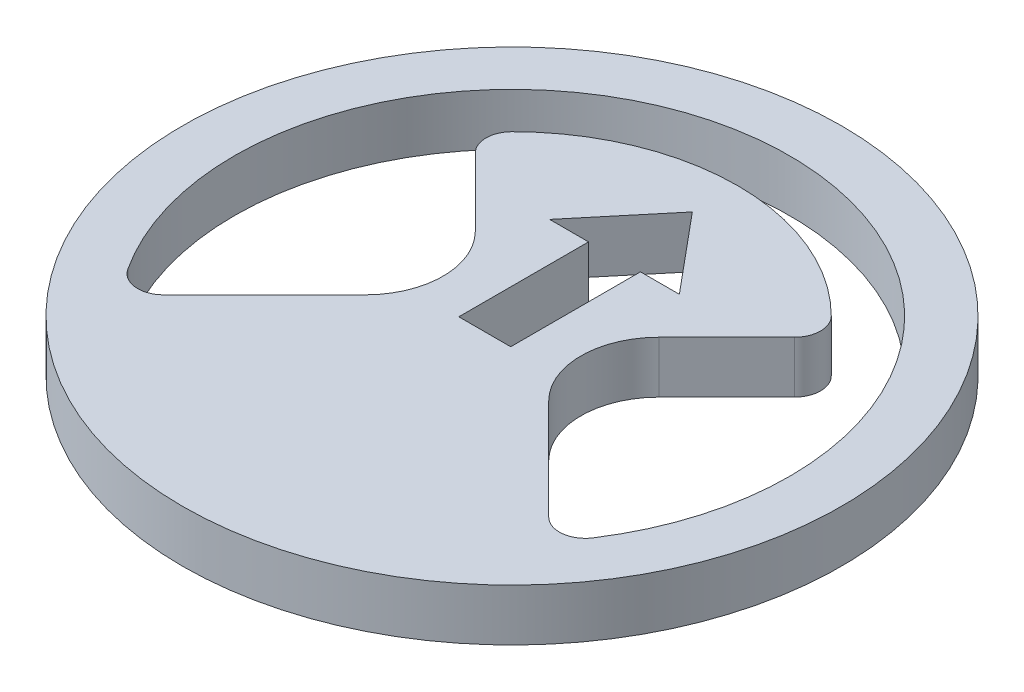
ISO-10303-21;
HEADER;
FILE_DESCRIPTION(('STEP AP214'),'2;1');
FILE_NAME('part.step','',(''),(''),'','','');
FILE_SCHEMA(('AUTOMOTIVE_DESIGN { 1 0 10303 214 1 1 1 1 }'));
ENDSEC;
DATA;
#1=APPLICATION_CONTEXT('core data for automotive mechanical design processes');
#2=APPLICATION_PROTOCOL_DEFINITION('international standard','automotive_design',2000,#1);
#3=PRODUCT_CONTEXT('',#1,'mechanical');
#4=PRODUCT('Part','Part','',(#3));
#5=PRODUCT_RELATED_PRODUCT_CATEGORY('part','',(#4));
#6=PRODUCT_DEFINITION_FORMATION('','',#4);
#7=PRODUCT_DEFINITION_CONTEXT('part definition',#1,'design');
#8=PRODUCT_DEFINITION('design','',#6,#7);
#9=PRODUCT_DEFINITION_SHAPE('','',#8);
#10=(LENGTH_UNIT() NAMED_UNIT(*) SI_UNIT(.MILLI.,.METRE.));
#11=(NAMED_UNIT(*) PLANE_ANGLE_UNIT() SI_UNIT($,.RADIAN.));
#12=(NAMED_UNIT(*) SI_UNIT($,.STERADIAN.) SOLID_ANGLE_UNIT());
#13=UNCERTAINTY_MEASURE_WITH_UNIT(LENGTH_MEASURE(1.E-05),#10,'distance_accuracy_value','');
#14=(GEOMETRIC_REPRESENTATION_CONTEXT(3) GLOBAL_UNCERTAINTY_ASSIGNED_CONTEXT((#13)) GLOBAL_UNIT_ASSIGNED_CONTEXT((#10,
#11,#12)) REPRESENTATION_CONTEXT('',''));
#15=CARTESIAN_POINT('',(0.,0.,0.));
#16=DIRECTION('',(0.,0.,1.));
#17=DIRECTION('',(1.,0.,0.));
#18=AXIS2_PLACEMENT_3D('',#15,#16,#17);
#19=CARTESIAN_POINT('',(0.,2.,0.));
#20=DIRECTION('',(0.,1.,0.));
#21=DIRECTION('',(0.,0.,1.));
#22=AXIS2_PLACEMENT_3D('',#19,#20,#21);
#23=PLANE('',#22);
#24=CARTESIAN_POINT('',(0.,2.,0.));
#25=DIRECTION('',(0.,1.,0.));
#26=DIRECTION('',(0.,0.,1.));
#27=AXIS2_PLACEMENT_3D('',#24,#25,#26);
#28=CIRCLE('',#27,12.7);
#29=CARTESIAN_POINT('',(0.,2.,12.7));
#30=VERTEX_POINT('',#29);
#31=EDGE_CURVE('E234',#30,#30,#28,.T.);
#32=ORIENTED_EDGE('',*,*,#31,.T.);
#33=EDGE_LOOP('',(#32));
#34=FACE_BOUND('',#33,.T.);
#35=DIRECTION('',(-0.707106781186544,0.,0.707106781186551));
#36=VECTOR('',#35,1.);
#37=CARTESIAN_POINT('',(0.707106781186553,2.,0.707106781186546));
#38=LINE('',#37,#36);
#39=CARTESIAN_POINT('',(6.15182899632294,2.,-4.7376154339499));
#40=VERTEX_POINT('',#39);
#41=CARTESIAN_POINT('',(3.53553390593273,2.,-2.12132034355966));
#42=VERTEX_POINT('',#41);
#43=EDGE_CURVE('E222',#40,#42,#38,.T.);
#44=ORIENTED_EDGE('',*,*,#43,.F.);
#45=CARTESIAN_POINT('',(5.44472221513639,2.,-5.44472221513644));
#46=DIRECTION('',(0.,1.,0.));
#47=DIRECTION('',(0.,0.,1.));
#48=AXIS2_PLACEMENT_3D('',#45,#46,#47);
#49=CIRCLE('',#48,1.);
#50=CARTESIAN_POINT('',(6.15182899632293,2.,-6.15182899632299));
#51=VERTEX_POINT('',#50);
#52=EDGE_CURVE('E291',#40,#51,#49,.T.);
#53=ORIENTED_EDGE('',*,*,#52,.T.);
#54=CARTESIAN_POINT('',(0.,2.,0.));
#55=DIRECTION('',(0.,1.,0.));
#56=DIRECTION('',(0.,0.,1.));
#57=AXIS2_PLACEMENT_3D('',#54,#55,#56);
#58=CIRCLE('',#57,8.7);
#59=CARTESIAN_POINT('',(-6.15182899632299,2.,-6.15182899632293));
#60=VERTEX_POINT('',#59);
#61=EDGE_CURVE('E219',#51,#60,#58,.T.);
#62=ORIENTED_EDGE('',*,*,#61,.T.);
#63=CARTESIAN_POINT('',(-5.44472221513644,2.,-5.44472221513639));
#64=DIRECTION('',(0.,1.,0.));
#65=DIRECTION('',(0.,0.,1.));
#66=AXIS2_PLACEMENT_3D('',#63,#64,#65);
#67=CIRCLE('',#66,1.);
#68=CARTESIAN_POINT('',(-6.15182899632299,2.,-4.73761543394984));
#69=VERTEX_POINT('',#68);
#70=EDGE_CURVE('E289',#60,#69,#67,.T.);
#71=ORIENTED_EDGE('',*,*,#70,.T.);
#72=DIRECTION('',(0.707106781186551,0.,0.707106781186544));
#73=VECTOR('',#72,1.);
#74=CARTESIAN_POINT('',(-0.707106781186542,2.,0.70710678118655));
#75=LINE('',#74,#73);
#76=CARTESIAN_POINT('',(-3.53553390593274,2.,-2.12132034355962));
#77=VERTEX_POINT('',#76);
#78=EDGE_CURVE('E208',#69,#77,#75,.T.);
#79=ORIENTED_EDGE('',*,*,#78,.T.);
#80=CARTESIAN_POINT('',(-5.65685424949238,2.,0.));
#81=DIRECTION('',(0.,1.,0.));
#82=DIRECTION('',(0.,0.,1.));
#83=AXIS2_PLACEMENT_3D('',#80,#81,#82);
#84=CIRCLE('',#83,3.);
#85=CARTESIAN_POINT('',(-3.53553390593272,2.,2.12132034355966));
#86=VERTEX_POINT('',#85);
#87=EDGE_CURVE('E271',#77,#86,#84,.F.);
#88=ORIENTED_EDGE('',*,*,#87,.T.);
#89=DIRECTION('',(-0.707106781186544,0.,0.707106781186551));
#90=VECTOR('',#89,1.);
#91=CARTESIAN_POINT('',(-0.707106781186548,2.,-0.707106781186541));
#92=LINE('',#91,#90);
#93=CARTESIAN_POINT('',(-7.41866397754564,2.,6.00445041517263));
#94=VERTEX_POINT('',#93);
#95=EDGE_CURVE('E230',#86,#94,#92,.T.);
#96=ORIENTED_EDGE('',*,*,#95,.T.);
#97=CARTESIAN_POINT('',(-8.12577075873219,2.,5.29734363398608));
#98=DIRECTION('',(0.,1.,0.));
#99=DIRECTION('',(0.,0.,1.));
#100=AXIS2_PLACEMENT_3D('',#97,#98,#99);
#101=CIRCLE('',#100,1.);
#102=CARTESIAN_POINT('',(-8.96347908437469,2.,5.84346153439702));
#103=VERTEX_POINT('',#102);
#104=EDGE_CURVE('E41',#94,#103,#101,.F.);
#105=ORIENTED_EDGE('',*,*,#104,.T.);
#106=CARTESIAN_POINT('',(0.,2.,0.));
#107=DIRECTION('',(0.,1.,0.));
#108=DIRECTION('',(0.,0.,1.));
#109=AXIS2_PLACEMENT_3D('',#106,#107,#108);
#110=CIRCLE('',#109,10.7);
#111=CARTESIAN_POINT('',(8.96347908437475,2.,5.84346153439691));
#112=VERTEX_POINT('',#111);
#113=EDGE_CURVE('E227',#112,#103,#110,.T.);
#114=ORIENTED_EDGE('',*,*,#113,.F.);
#115=CARTESIAN_POINT('',(8.12577075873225,2.,5.29734363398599));
#116=DIRECTION('',(0.,1.,0.));
#117=DIRECTION('',(0.,0.,1.));
#118=AXIS2_PLACEMENT_3D('',#115,#116,#117);
#119=CIRCLE('',#118,1.);
#120=CARTESIAN_POINT('',(7.41866397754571,2.,6.00445041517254));
#121=VERTEX_POINT('',#120);
#122=EDGE_CURVE('E304',#112,#121,#119,.F.);
#123=ORIENTED_EDGE('',*,*,#122,.T.);
#124=DIRECTION('',(0.707106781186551,0.,0.707106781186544));
#125=VECTOR('',#124,1.);
#126=CARTESIAN_POINT('',(0.707106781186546,2.,-0.707106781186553));
#127=LINE('',#126,#125);
#128=CARTESIAN_POINT('',(3.53553390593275,2.,2.12132034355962));
#129=VERTEX_POINT('',#128);
#130=EDGE_CURVE('E224',#129,#121,#127,.T.);
#131=ORIENTED_EDGE('',*,*,#130,.F.);
#132=CARTESIAN_POINT('',(5.65685424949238,2.,0.));
#133=DIRECTION('',(0.,1.,0.));
#134=DIRECTION('',(0.,0.,1.));
#135=AXIS2_PLACEMENT_3D('',#132,#133,#134);
#136=CIRCLE('',#135,3.);
#137=EDGE_CURVE('E266',#129,#42,#136,.F.);
#138=ORIENTED_EDGE('',*,*,#137,.T.);
#139=EDGE_LOOP('',(#44,#53,#62,#71,#79,#88,#96,#105,#114,#123,#131,#138));
#140=FACE_BOUND('',#139,.T.);
#141=DIRECTION('',(1.,0.,0.));
#142=VECTOR('',#141,1.);
#143=CARTESIAN_POINT('',(0.,2.,-3.95));
#144=LINE('',#143,#142);
#145=CARTESIAN_POINT('',(1.,2.,-3.95));
#146=VERTEX_POINT('',#145);
#147=CARTESIAN_POINT('',(2.50000000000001,2.,-3.95));
#148=VERTEX_POINT('',#147);
#149=EDGE_CURVE('E195',#146,#148,#144,.T.);
#150=ORIENTED_EDGE('',*,*,#149,.F.);
#151=DIRECTION('',(0.,0.,1.));
#152=VECTOR('',#151,1.);
#153=CARTESIAN_POINT('',(1.,2.,0.));
#154=LINE('',#153,#152);
#155=CARTESIAN_POINT('',(1.,2.,1.05));
#156=VERTEX_POINT('',#155);
#157=EDGE_CURVE('E48',#146,#156,#154,.T.);
#158=ORIENTED_EDGE('',*,*,#157,.T.);
#159=DIRECTION('',(1.,0.,0.));
#160=VECTOR('',#159,1.);
#161=CARTESIAN_POINT('',(0.,2.,1.05));
#162=LINE('',#161,#160);
#163=CARTESIAN_POINT('',(-0.999999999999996,2.,1.05));
#164=VERTEX_POINT('',#163);
#165=EDGE_CURVE('E181',#164,#156,#162,.T.);
#166=ORIENTED_EDGE('',*,*,#165,.F.);
#167=DIRECTION('',(0.,0.,1.));
#168=VECTOR('',#167,1.);
#169=CARTESIAN_POINT('',(-0.999999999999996,2.,0.));
#170=LINE('',#169,#168);
#171=CARTESIAN_POINT('',(-0.999999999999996,2.,-3.95));
#172=VERTEX_POINT('',#171);
#173=EDGE_CURVE('E184',#172,#164,#170,.T.);
#174=ORIENTED_EDGE('',*,*,#173,.F.);
#175=CARTESIAN_POINT('',(-2.49999999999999,2.,-3.95));
#176=VERTEX_POINT('',#175);
#177=EDGE_CURVE('E198',#176,#172,#144,.T.);
#178=ORIENTED_EDGE('',*,*,#177,.F.);
#179=DIRECTION('',(-0.64018439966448,0.,0.768221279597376));
#180=VECTOR('',#179,1.);
#181=CARTESIAN_POINT('',(-3.41803278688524,2.,-2.8483606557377));
#182=LINE('',#181,#180);
#183=CARTESIAN_POINT('',(0.,2.,-6.95));
#184=VERTEX_POINT('',#183);
#185=EDGE_CURVE('E201',#184,#176,#182,.T.);
#186=ORIENTED_EDGE('',*,*,#185,.F.);
#187=DIRECTION('',(0.64018439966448,0.,0.768221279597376));
#188=VECTOR('',#187,1.);
#189=CARTESIAN_POINT('',(3.41803278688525,2.,-2.84836065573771));
#190=LINE('',#189,#188);
#191=EDGE_CURVE('E197',#184,#148,#190,.T.);
#192=ORIENTED_EDGE('',*,*,#191,.T.);
#193=EDGE_LOOP('',(#150,#158,#166,#174,#178,#186,#192));
#194=FACE_BOUND('',#193,.T.);
#195=ADVANCED_FACE('F33',(#34,#140,#194),#23,.T.);
#196=CARTESIAN_POINT('',(0.,0.,0.));
#197=DIRECTION('',(0.,1.,0.));
#198=DIRECTION('',(0.,0.,1.));
#199=AXIS2_PLACEMENT_3D('',#196,#197,#198);
#200=PLANE('',#199);
#201=CARTESIAN_POINT('',(0.,0.,0.));
#202=DIRECTION('',(0.,1.,0.));
#203=DIRECTION('',(0.,0.,1.));
#204=AXIS2_PLACEMENT_3D('',#201,#202,#203);
#205=CIRCLE('',#204,8.7);
#206=CARTESIAN_POINT('',(6.15182899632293,0.,-6.15182899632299));
#207=VERTEX_POINT('',#206);
#208=CARTESIAN_POINT('',(-6.15182899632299,0.,-6.15182899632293));
#209=VERTEX_POINT('',#208);
#210=EDGE_CURVE('E237',#207,#209,#205,.T.);
#211=ORIENTED_EDGE('',*,*,#210,.F.);
#212=CARTESIAN_POINT('',(5.44472221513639,0.,-5.44472221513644));
#213=DIRECTION('',(0.,1.,0.));
#214=DIRECTION('',(0.,0.,1.));
#215=AXIS2_PLACEMENT_3D('',#212,#213,#214);
#216=CIRCLE('',#215,1.);
#217=CARTESIAN_POINT('',(6.15182899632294,0.,-4.7376154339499));
#218=VERTEX_POINT('',#217);
#219=EDGE_CURVE('E300',#207,#218,#216,.F.);
#220=ORIENTED_EDGE('',*,*,#219,.T.);
#221=DIRECTION('',(-0.707106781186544,0.,0.707106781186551));
#222=VECTOR('',#221,1.);
#223=CARTESIAN_POINT('',(0.707106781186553,0.,0.707106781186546));
#224=LINE('',#223,#222);
#225=CARTESIAN_POINT('',(3.53553390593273,0.,-2.12132034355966));
#226=VERTEX_POINT('',#225);
#227=EDGE_CURVE('E242',#218,#226,#224,.T.);
#228=ORIENTED_EDGE('',*,*,#227,.T.);
#229=CARTESIAN_POINT('',(5.65685424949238,0.,0.));
#230=DIRECTION('',(0.,1.,0.));
#231=DIRECTION('',(0.,0.,1.));
#232=AXIS2_PLACEMENT_3D('',#229,#230,#231);
#233=CIRCLE('',#232,3.);
#234=CARTESIAN_POINT('',(3.53553390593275,0.,2.12132034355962));
#235=VERTEX_POINT('',#234);
#236=EDGE_CURVE('E269',#226,#235,#233,.T.);
#237=ORIENTED_EDGE('',*,*,#236,.T.);
#238=DIRECTION('',(0.707106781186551,0.,0.707106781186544));
#239=VECTOR('',#238,1.);
#240=CARTESIAN_POINT('',(0.707106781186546,0.,-0.707106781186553));
#241=LINE('',#240,#239);
#242=CARTESIAN_POINT('',(7.41866397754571,0.,6.00445041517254));
#243=VERTEX_POINT('',#242);
#244=EDGE_CURVE('E244',#235,#243,#241,.T.);
#245=ORIENTED_EDGE('',*,*,#244,.T.);
#246=CARTESIAN_POINT('',(8.12577075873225,0.,5.29734363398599));
#247=DIRECTION('',(0.,1.,0.));
#248=DIRECTION('',(0.,0.,1.));
#249=AXIS2_PLACEMENT_3D('',#246,#247,#248);
#250=CIRCLE('',#249,1.);
#251=CARTESIAN_POINT('',(8.96347908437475,0.,5.84346153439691));
#252=VERTEX_POINT('',#251);
#253=EDGE_CURVE('E306',#243,#252,#250,.T.);
#254=ORIENTED_EDGE('',*,*,#253,.T.);
#255=CARTESIAN_POINT('',(0.,0.,0.));
#256=DIRECTION('',(0.,1.,0.));
#257=DIRECTION('',(0.,0.,1.));
#258=AXIS2_PLACEMENT_3D('',#255,#256,#257);
#259=CIRCLE('',#258,10.7);
#260=CARTESIAN_POINT('',(-8.96347908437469,0.,5.84346153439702));
#261=VERTEX_POINT('',#260);
#262=EDGE_CURVE('E247',#252,#261,#259,.T.);
#263=ORIENTED_EDGE('',*,*,#262,.T.);
#264=CARTESIAN_POINT('',(-8.12577075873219,0.,5.29734363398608));
#265=DIRECTION('',(0.,1.,0.));
#266=DIRECTION('',(0.,0.,1.));
#267=AXIS2_PLACEMENT_3D('',#264,#265,#266);
#268=CIRCLE('',#267,1.);
#269=CARTESIAN_POINT('',(-7.41866397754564,0.,6.00445041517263));
#270=VERTEX_POINT('',#269);
#271=EDGE_CURVE('E11',#261,#270,#268,.T.);
#272=ORIENTED_EDGE('',*,*,#271,.T.);
#273=DIRECTION('',(-0.707106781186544,0.,0.707106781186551));
#274=VECTOR('',#273,1.);
#275=CARTESIAN_POINT('',(-0.707106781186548,0.,-0.707106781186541));
#276=LINE('',#275,#274);
#277=CARTESIAN_POINT('',(-3.53553390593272,0.,2.12132034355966));
#278=VERTEX_POINT('',#277);
#279=EDGE_CURVE('E250',#278,#270,#276,.T.);
#280=ORIENTED_EDGE('',*,*,#279,.F.);
#281=CARTESIAN_POINT('',(-5.65685424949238,0.,0.));
#282=DIRECTION('',(0.,1.,0.));
#283=DIRECTION('',(0.,0.,1.));
#284=AXIS2_PLACEMENT_3D('',#281,#282,#283);
#285=CIRCLE('',#284,3.);
#286=CARTESIAN_POINT('',(-3.53553390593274,0.,-2.12132034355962));
#287=VERTEX_POINT('',#286);
#288=EDGE_CURVE('E273',#278,#287,#285,.T.);
#289=ORIENTED_EDGE('',*,*,#288,.T.);
#290=DIRECTION('',(0.707106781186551,0.,0.707106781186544));
#291=VECTOR('',#290,1.);
#292=CARTESIAN_POINT('',(-0.707106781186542,0.,0.70710678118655));
#293=LINE('',#292,#291);
#294=CARTESIAN_POINT('',(-6.15182899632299,0.,-4.73761543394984));
#295=VERTEX_POINT('',#294);
#296=EDGE_CURVE('E253',#295,#287,#293,.T.);
#297=ORIENTED_EDGE('',*,*,#296,.F.);
#298=CARTESIAN_POINT('',(-5.44472221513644,0.,-5.44472221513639));
#299=DIRECTION('',(0.,1.,0.));
#300=DIRECTION('',(0.,0.,1.));
#301=AXIS2_PLACEMENT_3D('',#298,#299,#300);
#302=CIRCLE('',#301,1.);
#303=EDGE_CURVE('E298',#295,#209,#302,.F.);
#304=ORIENTED_EDGE('',*,*,#303,.T.);
#305=EDGE_LOOP('',(#211,#220,#228,#237,#245,#254,#263,#272,#280,#289,#297,#304));
#306=FACE_BOUND('',#305,.T.);
#307=CARTESIAN_POINT('',(0.,0.,0.));
#308=DIRECTION('',(0.,1.,0.));
#309=DIRECTION('',(0.,0.,1.));
#310=AXIS2_PLACEMENT_3D('',#307,#308,#309);
#311=CIRCLE('',#310,12.7);
#312=CARTESIAN_POINT('',(0.,0.,12.7));
#313=VERTEX_POINT('',#312);
#314=EDGE_CURVE('E233',#313,#313,#311,.T.);
#315=ORIENTED_EDGE('',*,*,#314,.F.);
#316=EDGE_LOOP('',(#315));
#317=FACE_BOUND('',#316,.T.);
#318=DIRECTION('',(0.,0.,1.));
#319=VECTOR('',#318,1.);
#320=CARTESIAN_POINT('',(1.,0.,0.));
#321=LINE('',#320,#319);
#322=CARTESIAN_POINT('',(1.,0.,-3.95));
#323=VERTEX_POINT('',#322);
#324=CARTESIAN_POINT('',(1.,0.,1.05));
#325=VERTEX_POINT('',#324);
#326=EDGE_CURVE('E164',#323,#325,#321,.T.);
#327=ORIENTED_EDGE('',*,*,#326,.F.);
#328=DIRECTION('',(1.,0.,0.));
#329=VECTOR('',#328,1.);
#330=CARTESIAN_POINT('',(0.,0.,-3.95));
#331=LINE('',#330,#329);
#332=CARTESIAN_POINT('',(2.50000000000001,0.,-3.95));
#333=VERTEX_POINT('',#332);
#334=EDGE_CURVE('E170',#323,#333,#331,.T.);
#335=ORIENTED_EDGE('',*,*,#334,.T.);
#336=DIRECTION('',(0.64018439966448,0.,0.768221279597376));
#337=VECTOR('',#336,1.);
#338=CARTESIAN_POINT('',(3.41803278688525,0.,-2.84836065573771));
#339=LINE('',#338,#337);
#340=CARTESIAN_POINT('',(0.,0.,-6.95));
#341=VERTEX_POINT('',#340);
#342=EDGE_CURVE('E174',#341,#333,#339,.T.);
#343=ORIENTED_EDGE('',*,*,#342,.F.);
#344=DIRECTION('',(-0.64018439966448,0.,0.768221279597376));
#345=VECTOR('',#344,1.);
#346=CARTESIAN_POINT('',(-3.41803278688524,0.,-2.8483606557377));
#347=LINE('',#346,#345);
#348=CARTESIAN_POINT('',(-2.49999999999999,0.,-3.95));
#349=VERTEX_POINT('',#348);
#350=EDGE_CURVE('E188',#341,#349,#347,.T.);
#351=ORIENTED_EDGE('',*,*,#350,.T.);
#352=CARTESIAN_POINT('',(-0.999999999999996,0.,-3.95));
#353=VERTEX_POINT('',#352);
#354=EDGE_CURVE('E176',#349,#353,#331,.T.);
#355=ORIENTED_EDGE('',*,*,#354,.T.);
#356=DIRECTION('',(0.,0.,1.));
#357=VECTOR('',#356,1.);
#358=CARTESIAN_POINT('',(-0.999999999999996,0.,0.));
#359=LINE('',#358,#357);
#360=CARTESIAN_POINT('',(-0.999999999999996,0.,1.05));
#361=VERTEX_POINT('',#360);
#362=EDGE_CURVE('E191',#353,#361,#359,.T.);
#363=ORIENTED_EDGE('',*,*,#362,.T.);
#364=DIRECTION('',(1.,0.,0.));
#365=VECTOR('',#364,1.);
#366=CARTESIAN_POINT('',(0.,0.,1.05));
#367=LINE('',#366,#365);
#368=EDGE_CURVE('E167',#361,#325,#367,.T.);
#369=ORIENTED_EDGE('',*,*,#368,.T.);
#370=EDGE_LOOP('',(#327,#335,#343,#351,#355,#363,#369));
#371=FACE_BOUND('',#370,.T.);
#372=ADVANCED_FACE('F178',(#306,#317,#371),#200,.F.);
#373=CARTESIAN_POINT('',(0.,2.,0.));
#374=DIRECTION('',(0.,-1.,0.));
#375=DIRECTION('',(0.,0.,-1.));
#376=AXIS2_PLACEMENT_3D('',#373,#374,#375);
#377=CYLINDRICAL_SURFACE('',#376,12.7);
#378=ORIENTED_EDGE('',*,*,#31,.F.);
#379=EDGE_LOOP('',(#378));
#380=FACE_BOUND('',#379,.T.);
#381=ORIENTED_EDGE('',*,*,#314,.T.);
#382=EDGE_LOOP('',(#381));
#383=FACE_BOUND('',#382,.T.);
#384=ADVANCED_FACE('F379',(#380,#383),#377,.T.);
#385=CARTESIAN_POINT('',(-0.707106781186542,-0.54,0.70710678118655));
#386=DIRECTION('',(-0.707106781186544,0.,0.707106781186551));
#387=DIRECTION('',(0.707106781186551,0.,0.707106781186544));
#388=AXIS2_PLACEMENT_3D('',#385,#386,#387);
#389=PLANE('',#388);
#390=ORIENTED_EDGE('',*,*,#78,.F.);
#391=DIRECTION('',(0.,1.,0.));
#392=VECTOR('',#391,1.);
#393=CARTESIAN_POINT('',(-6.15182899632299,-0.54,-4.73761543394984));
#394=LINE('',#393,#392);
#395=EDGE_CURVE('E302',#69,#295,#394,.F.);
#396=ORIENTED_EDGE('',*,*,#395,.T.);
#397=ORIENTED_EDGE('',*,*,#296,.T.);
#398=DIRECTION('',(0.,1.,0.));
#399=VECTOR('',#398,1.);
#400=CARTESIAN_POINT('',(-3.53553390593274,2.,-2.12132034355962));
#401=LINE('',#400,#399);
#402=EDGE_CURVE('E261',#287,#77,#401,.T.);
#403=ORIENTED_EDGE('',*,*,#402,.T.);
#404=EDGE_LOOP('',(#390,#396,#397,#403));
#405=FACE_BOUND('',#404,.T.);
#406=ADVANCED_FACE('F382',(#405),#389,.T.);
#407=CARTESIAN_POINT('',(-0.707106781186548,-0.54,-0.707106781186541));
#408=DIRECTION('',(-0.707106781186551,0.,-0.707106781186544));
#409=DIRECTION('',(-0.707106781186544,0.,0.707106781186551));
#410=AXIS2_PLACEMENT_3D('',#407,#408,#409);
#411=PLANE('',#410);
#412=ORIENTED_EDGE('',*,*,#279,.T.);
#413=DIRECTION('',(0.,1.,0.));
#414=VECTOR('',#413,1.);
#415=CARTESIAN_POINT('',(-7.41866397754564,-0.54,6.00445041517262));
#416=LINE('',#415,#414);
#417=EDGE_CURVE('E283',#270,#94,#416,.T.);
#418=ORIENTED_EDGE('',*,*,#417,.T.);
#419=ORIENTED_EDGE('',*,*,#95,.F.);
#420=DIRECTION('',(0.,1.,0.));
#421=VECTOR('',#420,1.);
#422=CARTESIAN_POINT('',(-3.53553390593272,0.,2.12132034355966));
#423=LINE('',#422,#421);
#424=EDGE_CURVE('E264',#86,#278,#423,.F.);
#425=ORIENTED_EDGE('',*,*,#424,.T.);
#426=EDGE_LOOP('',(#412,#418,#419,#425));
#427=FACE_BOUND('',#426,.T.);
#428=ADVANCED_FACE('F327',(#427),#411,.T.);
#429=CARTESIAN_POINT('',(0.,-0.54,0.));
#430=DIRECTION('',(0.,1.,0.));
#431=DIRECTION('',(0.,0.,1.));
#432=AXIS2_PLACEMENT_3D('',#429,#430,#431);
#433=CYLINDRICAL_SURFACE('',#432,10.7);
#434=ORIENTED_EDGE('',*,*,#262,.F.);
#435=DIRECTION('',(0.,1.,0.));
#436=VECTOR('',#435,1.);
#437=CARTESIAN_POINT('',(8.96347908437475,-0.54,5.84346153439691));
#438=LINE('',#437,#436);
#439=EDGE_CURVE('E278',#252,#112,#438,.T.);
#440=ORIENTED_EDGE('',*,*,#439,.T.);
#441=ORIENTED_EDGE('',*,*,#113,.T.);
#442=DIRECTION('',(0.,1.,0.));
#443=VECTOR('',#442,1.);
#444=CARTESIAN_POINT('',(-8.96347908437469,-0.54,5.84346153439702));
#445=LINE('',#444,#443);
#446=EDGE_CURVE('E276',#103,#261,#445,.F.);
#447=ORIENTED_EDGE('',*,*,#446,.T.);
#448=EDGE_LOOP('',(#434,#440,#441,#447));
#449=FACE_BOUND('',#448,.T.);
#450=ADVANCED_FACE('F317',(#449),#433,.F.);
#451=CARTESIAN_POINT('',(0.707106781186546,-0.54,-0.707106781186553));
#452=DIRECTION('',(-0.707106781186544,0.,0.707106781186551));
#453=DIRECTION('',(0.707106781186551,0.,0.707106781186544));
#454=AXIS2_PLACEMENT_3D('',#451,#452,#453);
#455=PLANE('',#454);
#456=ORIENTED_EDGE('',*,*,#130,.T.);
#457=DIRECTION('',(0.,-1.,0.));
#458=VECTOR('',#457,1.);
#459=CARTESIAN_POINT('',(7.41866397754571,0.,6.00445041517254));
#460=LINE('',#459,#458);
#461=EDGE_CURVE('E281',#121,#243,#460,.T.);
#462=ORIENTED_EDGE('',*,*,#461,.T.);
#463=ORIENTED_EDGE('',*,*,#244,.F.);
#464=DIRECTION('',(0.,1.,0.));
#465=VECTOR('',#464,1.);
#466=CARTESIAN_POINT('',(3.53553390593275,2.,2.12132034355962));
#467=LINE('',#466,#465);
#468=EDGE_CURVE('E255',#235,#129,#467,.T.);
#469=ORIENTED_EDGE('',*,*,#468,.T.);
#470=EDGE_LOOP('',(#456,#462,#463,#469));
#471=FACE_BOUND('',#470,.T.);
#472=ADVANCED_FACE('F358',(#471),#455,.F.);
#473=CARTESIAN_POINT('',(0.707106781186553,-0.54,0.707106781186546));
#474=DIRECTION('',(-0.707106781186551,0.,-0.707106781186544));
#475=DIRECTION('',(-0.707106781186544,0.,0.707106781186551));
#476=AXIS2_PLACEMENT_3D('',#473,#474,#475);
#477=PLANE('',#476);
#478=ORIENTED_EDGE('',*,*,#227,.F.);
#479=DIRECTION('',(0.,-1.,0.));
#480=VECTOR('',#479,1.);
#481=CARTESIAN_POINT('',(6.15182899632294,2.,-4.7376154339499));
#482=LINE('',#481,#480);
#483=EDGE_CURVE('E286',#218,#40,#482,.F.);
#484=ORIENTED_EDGE('',*,*,#483,.T.);
#485=ORIENTED_EDGE('',*,*,#43,.T.);
#486=DIRECTION('',(0.,1.,0.));
#487=VECTOR('',#486,1.);
#488=CARTESIAN_POINT('',(3.53553390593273,0.,-2.12132034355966));
#489=LINE('',#488,#487);
#490=EDGE_CURVE('E258',#42,#226,#489,.F.);
#491=ORIENTED_EDGE('',*,*,#490,.T.);
#492=EDGE_LOOP('',(#478,#484,#485,#491));
#493=FACE_BOUND('',#492,.T.);
#494=ADVANCED_FACE('F350',(#493),#477,.F.);
#495=CARTESIAN_POINT('',(0.,-0.54,0.));
#496=DIRECTION('',(0.,1.,0.));
#497=DIRECTION('',(0.,0.,1.));
#498=AXIS2_PLACEMENT_3D('',#495,#496,#497);
#499=CYLINDRICAL_SURFACE('',#498,8.7);
#500=ORIENTED_EDGE('',*,*,#61,.F.);
#501=DIRECTION('',(0.,1.,0.));
#502=VECTOR('',#501,1.);
#503=CARTESIAN_POINT('',(6.15182899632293,-0.54,-6.15182899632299));
#504=LINE('',#503,#502);
#505=EDGE_CURVE('E296',#51,#207,#504,.F.);
#506=ORIENTED_EDGE('',*,*,#505,.T.);
#507=ORIENTED_EDGE('',*,*,#210,.T.);
#508=DIRECTION('',(0.,1.,0.));
#509=VECTOR('',#508,1.);
#510=CARTESIAN_POINT('',(-6.15182899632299,-0.54,-6.15182899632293));
#511=LINE('',#510,#509);
#512=EDGE_CURVE('E293',#209,#60,#511,.T.);
#513=ORIENTED_EDGE('',*,*,#512,.T.);
#514=EDGE_LOOP('',(#500,#506,#507,#513));
#515=FACE_BOUND('',#514,.T.);
#516=ADVANCED_FACE('F341',(#515),#499,.T.);
#517=CARTESIAN_POINT('',(5.65685424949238,-0.54,0.));
#518=DIRECTION('',(0.,-1.,0.));
#519=DIRECTION('',(0.,0.,-1.));
#520=AXIS2_PLACEMENT_3D('',#517,#518,#519);
#521=CYLINDRICAL_SURFACE('',#520,3.);
#522=ORIENTED_EDGE('',*,*,#236,.F.);
#523=ORIENTED_EDGE('',*,*,#490,.F.);
#524=ORIENTED_EDGE('',*,*,#137,.F.);
#525=ORIENTED_EDGE('',*,*,#468,.F.);
#526=EDGE_LOOP('',(#522,#523,#524,#525));
#527=FACE_BOUND('',#526,.T.);
#528=ADVANCED_FACE('F361',(#527),#521,.F.);
#529=CARTESIAN_POINT('',(-5.65685424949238,-0.54,0.));
#530=DIRECTION('',(0.,-1.,0.));
#531=DIRECTION('',(0.,0.,-1.));
#532=AXIS2_PLACEMENT_3D('',#529,#530,#531);
#533=CYLINDRICAL_SURFACE('',#532,3.);
#534=ORIENTED_EDGE('',*,*,#288,.F.);
#535=ORIENTED_EDGE('',*,*,#424,.F.);
#536=ORIENTED_EDGE('',*,*,#87,.F.);
#537=ORIENTED_EDGE('',*,*,#402,.F.);
#538=EDGE_LOOP('',(#534,#535,#536,#537));
#539=FACE_BOUND('',#538,.T.);
#540=ADVANCED_FACE('F331',(#539),#533,.F.);
#541=CARTESIAN_POINT('',(8.12577075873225,-0.54,5.29734363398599));
#542=DIRECTION('',(0.,1.,0.));
#543=DIRECTION('',(0.,0.,1.));
#544=AXIS2_PLACEMENT_3D('',#541,#542,#543);
#545=CYLINDRICAL_SURFACE('',#544,1.);
#546=ORIENTED_EDGE('',*,*,#253,.F.);
#547=ORIENTED_EDGE('',*,*,#461,.F.);
#548=ORIENTED_EDGE('',*,*,#122,.F.);
#549=ORIENTED_EDGE('',*,*,#439,.F.);
#550=EDGE_LOOP('',(#546,#547,#548,#549));
#551=FACE_BOUND('',#550,.T.);
#552=ADVANCED_FACE('F363',(#551),#545,.F.);
#553=CARTESIAN_POINT('',(-8.12577075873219,-0.54,5.29734363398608));
#554=DIRECTION('',(0.,1.,0.));
#555=DIRECTION('',(0.,0.,1.));
#556=AXIS2_PLACEMENT_3D('',#553,#554,#555);
#557=CYLINDRICAL_SURFACE('',#556,1.);
#558=ORIENTED_EDGE('',*,*,#271,.F.);
#559=ORIENTED_EDGE('',*,*,#446,.F.);
#560=ORIENTED_EDGE('',*,*,#104,.F.);
#561=ORIENTED_EDGE('',*,*,#417,.F.);
#562=EDGE_LOOP('',(#558,#559,#560,#561));
#563=FACE_BOUND('',#562,.T.);
#564=ADVANCED_FACE('F320',(#563),#557,.F.);
#565=CARTESIAN_POINT('',(5.44472221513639,-0.54,-5.44472221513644));
#566=DIRECTION('',(0.,1.,0.));
#567=DIRECTION('',(0.,0.,1.));
#568=AXIS2_PLACEMENT_3D('',#565,#566,#567);
#569=CYLINDRICAL_SURFACE('',#568,1.);
#570=ORIENTED_EDGE('',*,*,#219,.F.);
#571=ORIENTED_EDGE('',*,*,#505,.F.);
#572=ORIENTED_EDGE('',*,*,#52,.F.);
#573=ORIENTED_EDGE('',*,*,#483,.F.);
#574=EDGE_LOOP('',(#570,#571,#572,#573));
#575=FACE_BOUND('',#574,.T.);
#576=ADVANCED_FACE('F347',(#575),#569,.T.);
#577=CARTESIAN_POINT('',(-5.44472221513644,-0.54,-5.44472221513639));
#578=DIRECTION('',(0.,1.,0.));
#579=DIRECTION('',(0.,0.,1.));
#580=AXIS2_PLACEMENT_3D('',#577,#578,#579);
#581=CYLINDRICAL_SURFACE('',#580,1.);
#582=ORIENTED_EDGE('',*,*,#303,.F.);
#583=ORIENTED_EDGE('',*,*,#395,.F.);
#584=ORIENTED_EDGE('',*,*,#70,.F.);
#585=ORIENTED_EDGE('',*,*,#512,.F.);
#586=EDGE_LOOP('',(#582,#583,#584,#585));
#587=FACE_BOUND('',#586,.T.);
#588=ADVANCED_FACE('F35',(#587),#581,.T.);
#589=CARTESIAN_POINT('',(1.,0.,0.));
#590=DIRECTION('',(-1.,0.,0.));
#591=DIRECTION('',(0.,0.,1.));
#592=AXIS2_PLACEMENT_3D('',#589,#590,#591);
#593=PLANE('',#592);
#594=ORIENTED_EDGE('',*,*,#157,.F.);
#595=DIRECTION('',(0.,1.,0.));
#596=VECTOR('',#595,1.);
#597=CARTESIAN_POINT('',(1.,0.,-3.95));
#598=LINE('',#597,#596);
#599=EDGE_CURVE('E161',#323,#146,#598,.T.);
#600=ORIENTED_EDGE('',*,*,#599,.F.);
#601=ORIENTED_EDGE('',*,*,#326,.T.);
#602=DIRECTION('',(0.,1.,0.));
#603=VECTOR('',#602,1.);
#604=CARTESIAN_POINT('',(1.,0.,1.05));
#605=LINE('',#604,#603);
#606=EDGE_CURVE('E206',#325,#156,#605,.T.);
#607=ORIENTED_EDGE('',*,*,#606,.T.);
#608=EDGE_LOOP('',(#594,#600,#601,#607));
#609=FACE_BOUND('',#608,.T.);
#610=ADVANCED_FACE('F162',(#609),#593,.T.);
#611=CARTESIAN_POINT('',(0.,0.,1.05));
#612=DIRECTION('',(0.,0.,1.));
#613=DIRECTION('',(1.,0.,0.));
#614=AXIS2_PLACEMENT_3D('',#611,#612,#613);
#615=PLANE('',#614);
#616=ORIENTED_EDGE('',*,*,#165,.T.);
#617=ORIENTED_EDGE('',*,*,#606,.F.);
#618=ORIENTED_EDGE('',*,*,#368,.F.);
#619=DIRECTION('',(0.,1.,0.));
#620=VECTOR('',#619,1.);
#621=CARTESIAN_POINT('',(-0.999999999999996,0.,1.05));
#622=LINE('',#621,#620);
#623=EDGE_CURVE('E209',#361,#164,#622,.T.);
#624=ORIENTED_EDGE('',*,*,#623,.T.);
#625=EDGE_LOOP('',(#616,#617,#618,#624));
#626=FACE_BOUND('',#625,.T.);
#627=ADVANCED_FACE('F405',(#626),#615,.F.);
#628=CARTESIAN_POINT('',(-0.999999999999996,0.,0.));
#629=DIRECTION('',(-1.,0.,0.));
#630=DIRECTION('',(0.,0.,1.));
#631=AXIS2_PLACEMENT_3D('',#628,#629,#630);
#632=PLANE('',#631);
#633=ORIENTED_EDGE('',*,*,#173,.T.);
#634=ORIENTED_EDGE('',*,*,#623,.F.);
#635=ORIENTED_EDGE('',*,*,#362,.F.);
#636=DIRECTION('',(0.,1.,0.));
#637=VECTOR('',#636,1.);
#638=CARTESIAN_POINT('',(-0.999999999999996,0.,-3.95));
#639=LINE('',#638,#637);
#640=EDGE_CURVE('E211',#353,#172,#639,.T.);
#641=ORIENTED_EDGE('',*,*,#640,.T.);
#642=EDGE_LOOP('',(#633,#634,#635,#641));
#643=FACE_BOUND('',#642,.T.);
#644=ADVANCED_FACE('F417',(#643),#632,.F.);
#645=CARTESIAN_POINT('',(0.,0.,-3.95));
#646=DIRECTION('',(0.,0.,1.));
#647=DIRECTION('',(1.,0.,0.));
#648=AXIS2_PLACEMENT_3D('',#645,#646,#647);
#649=PLANE('',#648);
#650=ORIENTED_EDGE('',*,*,#177,.T.);
#651=ORIENTED_EDGE('',*,*,#640,.F.);
#652=ORIENTED_EDGE('',*,*,#354,.F.);
#653=DIRECTION('',(0.,1.,0.));
#654=VECTOR('',#653,1.);
#655=CARTESIAN_POINT('',(-2.49999999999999,0.,-3.95));
#656=LINE('',#655,#654);
#657=EDGE_CURVE('E213',#349,#176,#656,.T.);
#658=ORIENTED_EDGE('',*,*,#657,.T.);
#659=EDGE_LOOP('',(#650,#651,#652,#658));
#660=FACE_BOUND('',#659,.T.);
#661=ADVANCED_FACE('F413',(#660),#649,.F.);
#662=CARTESIAN_POINT('',(-3.41803278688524,0.,-2.8483606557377));
#663=DIRECTION('',(-0.768221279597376,0.,-0.64018439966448));
#664=DIRECTION('',(-0.64018439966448,0.,0.768221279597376));
#665=AXIS2_PLACEMENT_3D('',#662,#663,#664);
#666=PLANE('',#665);
#667=ORIENTED_EDGE('',*,*,#185,.T.);
#668=ORIENTED_EDGE('',*,*,#657,.F.);
#669=ORIENTED_EDGE('',*,*,#350,.F.);
#670=DIRECTION('',(0.,1.,0.));
#671=VECTOR('',#670,1.);
#672=CARTESIAN_POINT('',(0.,0.,-6.95));
#673=LINE('',#672,#671);
#674=EDGE_CURVE('E215',#341,#184,#673,.T.);
#675=ORIENTED_EDGE('',*,*,#674,.T.);
#676=EDGE_LOOP('',(#667,#668,#669,#675));
#677=FACE_BOUND('',#676,.T.);
#678=ADVANCED_FACE('F409',(#677),#666,.F.);
#679=CARTESIAN_POINT('',(3.41803278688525,0.,-2.84836065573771));
#680=DIRECTION('',(-0.768221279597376,0.,0.64018439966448));
#681=DIRECTION('',(0.64018439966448,0.,0.768221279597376));
#682=AXIS2_PLACEMENT_3D('',#679,#680,#681);
#683=PLANE('',#682);
#684=ORIENTED_EDGE('',*,*,#191,.F.);
#685=ORIENTED_EDGE('',*,*,#674,.F.);
#686=ORIENTED_EDGE('',*,*,#342,.T.);
#687=DIRECTION('',(0.,1.,0.));
#688=VECTOR('',#687,1.);
#689=CARTESIAN_POINT('',(2.50000000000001,0.,-3.95));
#690=LINE('',#689,#688);
#691=EDGE_CURVE('E56',#333,#148,#690,.T.);
#692=ORIENTED_EDGE('',*,*,#691,.T.);
#693=EDGE_LOOP('',(#684,#685,#686,#692));
#694=FACE_BOUND('',#693,.T.);
#695=ADVANCED_FACE('F406',(#694),#683,.T.);
#696=ORIENTED_EDGE('',*,*,#149,.T.);
#697=ORIENTED_EDGE('',*,*,#691,.F.);
#698=ORIENTED_EDGE('',*,*,#334,.F.);
#699=ORIENTED_EDGE('',*,*,#599,.T.);
#700=EDGE_LOOP('',(#696,#697,#698,#699));
#701=FACE_BOUND('',#700,.T.);
#702=ADVANCED_FACE('F171',(#701),#649,.F.);
#703=CLOSED_SHELL('',(#195,#372,#384,#406,#428,#450,#472,#494,#516,#528,#540,#552,#564,#576,
#588,#610,#627,#644,#661,#678,#695,#702));
#704=MANIFOLD_SOLID_BREP('B2',#703);
#705=ADVANCED_BREP_SHAPE_REPRESENTATION('',(#18,#704),#14);
#706=SHAPE_DEFINITION_REPRESENTATION(#9,#705);
ENDSEC;
END-ISO-10303-21;
